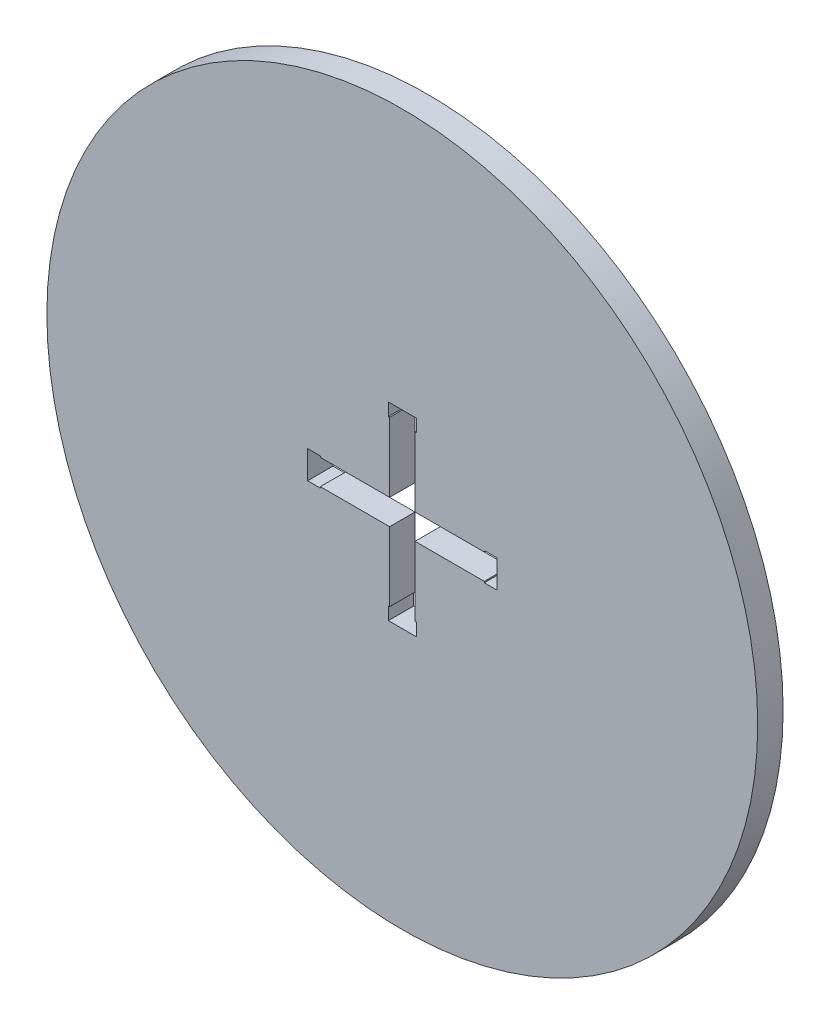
ISO-10303-21;
HEADER;
FILE_DESCRIPTION(('STEP AP214'),'2;1');
FILE_NAME('part.step','',(''),(''),'','','');
FILE_SCHEMA(('AUTOMOTIVE_DESIGN { 1 0 10303 214 1 1 1 1 }'));
ENDSEC;
DATA;
#1=APPLICATION_CONTEXT('core data for automotive mechanical design processes');
#2=APPLICATION_PROTOCOL_DEFINITION('international standard','automotive_design',2000,#1);
#3=PRODUCT_CONTEXT('',#1,'mechanical');
#4=PRODUCT('Part','Part','',(#3));
#5=PRODUCT_RELATED_PRODUCT_CATEGORY('part','',(#4));
#6=PRODUCT_DEFINITION_FORMATION('','',#4);
#7=PRODUCT_DEFINITION_CONTEXT('part definition',#1,'design');
#8=PRODUCT_DEFINITION('design','',#6,#7);
#9=PRODUCT_DEFINITION_SHAPE('','',#8);
#10=(LENGTH_UNIT() NAMED_UNIT(*) SI_UNIT(.MILLI.,.METRE.));
#11=(NAMED_UNIT(*) PLANE_ANGLE_UNIT() SI_UNIT($,.RADIAN.));
#12=(NAMED_UNIT(*) SI_UNIT($,.STERADIAN.) SOLID_ANGLE_UNIT());
#13=UNCERTAINTY_MEASURE_WITH_UNIT(LENGTH_MEASURE(1.E-05),#10,'distance_accuracy_value','');
#14=(GEOMETRIC_REPRESENTATION_CONTEXT(3) GLOBAL_UNCERTAINTY_ASSIGNED_CONTEXT((#13)) GLOBAL_UNIT_ASSIGNED_CONTEXT((#10,
#11,#12)) REPRESENTATION_CONTEXT('',''));
#15=CARTESIAN_POINT('',(0.,0.,0.));
#16=DIRECTION('',(0.,0.,1.));
#17=DIRECTION('',(1.,0.,0.));
#18=AXIS2_PLACEMENT_3D('',#15,#16,#17);
#19=CARTESIAN_POINT('',(0.,0.,12.7));
#20=DIRECTION('',(0.,0.,1.));
#21=DIRECTION('',(1.,0.,0.));
#22=AXIS2_PLACEMENT_3D('',#19,#20,#21);
#23=PLANE('',#22);
#24=DIRECTION('',(1.,0.,0.));
#25=VECTOR('',#24,1.);
#26=CARTESIAN_POINT('',(-6.35000000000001,-41.021,12.7));
#27=LINE('',#26,#25);
#28=CARTESIAN_POINT('',(-6.98500000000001,-41.021,12.7));
#29=VERTEX_POINT('',#28);
#30=CARTESIAN_POINT('',(-6.35000000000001,-41.021,12.7));
#31=VERTEX_POINT('',#30);
#32=EDGE_CURVE('E240',#29,#31,#27,.T.);
#33=ORIENTED_EDGE('',*,*,#32,.T.);
#34=DIRECTION('',(0.,-1.,0.));
#35=VECTOR('',#34,1.);
#36=CARTESIAN_POINT('',(-6.35000000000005,-6.35,12.7));
#37=LINE('',#36,#35);
#38=CARTESIAN_POINT('',(-6.35000000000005,-6.35,12.7));
#39=VERTEX_POINT('',#38);
#40=EDGE_CURVE('E230',#39,#31,#37,.T.);
#41=ORIENTED_EDGE('',*,*,#40,.F.);
#42=DIRECTION('',(1.,0.,0.));
#43=VECTOR('',#42,1.);
#44=CARTESIAN_POINT('',(-47.371,-6.35,12.7));
#45=LINE('',#44,#43);
#46=CARTESIAN_POINT('',(-41.021,-6.35,12.7));
#47=VERTEX_POINT('',#46);
#48=EDGE_CURVE('E388',#47,#39,#45,.T.);
#49=ORIENTED_EDGE('',*,*,#48,.F.);
#50=DIRECTION('',(0.,-1.,0.));
#51=VECTOR('',#50,1.);
#52=CARTESIAN_POINT('',(-41.021,-6.35000000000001,12.7));
#53=LINE('',#52,#51);
#54=CARTESIAN_POINT('',(-41.021,-6.98500000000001,12.7));
#55=VERTEX_POINT('',#54);
#56=EDGE_CURVE('E48',#47,#55,#53,.T.);
#57=ORIENTED_EDGE('',*,*,#56,.T.);
#58=DIRECTION('',(-1.,0.,0.));
#59=VECTOR('',#58,1.);
#60=CARTESIAN_POINT('',(-47.371,-6.98500000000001,12.7));
#61=LINE('',#60,#59);
#62=CARTESIAN_POINT('',(-47.371,-6.98500000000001,12.7));
#63=VERTEX_POINT('',#62);
#64=EDGE_CURVE('E258',#55,#63,#61,.T.);
#65=ORIENTED_EDGE('',*,*,#64,.T.);
#66=DIRECTION('',(0.,-1.,0.));
#67=VECTOR('',#66,1.);
#68=CARTESIAN_POINT('',(-47.371,6.35,12.7));
#69=LINE('',#68,#67);
#70=CARTESIAN_POINT('',(-47.371,6.98500000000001,12.7));
#71=VERTEX_POINT('',#70);
#72=EDGE_CURVE('E386',#71,#63,#69,.T.);
#73=ORIENTED_EDGE('',*,*,#72,.F.);
#74=DIRECTION('',(-1.,0.,0.));
#75=VECTOR('',#74,1.);
#76=CARTESIAN_POINT('',(-47.371,6.98500000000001,12.7));
#77=LINE('',#76,#75);
#78=CARTESIAN_POINT('',(-41.021,6.98500000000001,12.7));
#79=VERTEX_POINT('',#78);
#80=EDGE_CURVE('E292',#79,#71,#77,.T.);
#81=ORIENTED_EDGE('',*,*,#80,.F.);
#82=DIRECTION('',(0.,1.,0.));
#83=VECTOR('',#82,1.);
#84=CARTESIAN_POINT('',(-41.021,6.35000000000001,12.7));
#85=LINE('',#84,#83);
#86=CARTESIAN_POINT('',(-41.021,6.35000000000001,12.7));
#87=VERTEX_POINT('',#86);
#88=EDGE_CURVE('E295',#87,#79,#85,.T.);
#89=ORIENTED_EDGE('',*,*,#88,.F.);
#90=DIRECTION('',(-1.,0.,0.));
#91=VECTOR('',#90,1.);
#92=CARTESIAN_POINT('',(-6.35000000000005,6.35,12.7));
#93=LINE('',#92,#91);
#94=CARTESIAN_POINT('',(-6.35000000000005,6.35,12.7));
#95=VERTEX_POINT('',#94);
#96=EDGE_CURVE('E382',#95,#87,#93,.T.);
#97=ORIENTED_EDGE('',*,*,#96,.F.);
#98=DIRECTION('',(0.,-1.,0.));
#99=VECTOR('',#98,1.);
#100=CARTESIAN_POINT('',(-6.34999999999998,47.371,12.7));
#101=LINE('',#100,#99);
#102=CARTESIAN_POINT('',(-6.35000000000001,41.021,12.7));
#103=VERTEX_POINT('',#102);
#104=EDGE_CURVE('E380',#103,#95,#101,.T.);
#105=ORIENTED_EDGE('',*,*,#104,.F.);
#106=DIRECTION('',(1.,0.,0.));
#107=VECTOR('',#106,1.);
#108=CARTESIAN_POINT('',(-6.35000000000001,41.021,12.7));
#109=LINE('',#108,#107);
#110=CARTESIAN_POINT('',(-6.98500000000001,41.021,12.7));
#111=VERTEX_POINT('',#110);
#112=EDGE_CURVE('E273',#111,#103,#109,.T.);
#113=ORIENTED_EDGE('',*,*,#112,.F.);
#114=DIRECTION('',(0.,-1.,0.));
#115=VECTOR('',#114,1.);
#116=CARTESIAN_POINT('',(-6.98500000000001,47.371,12.7));
#117=LINE('',#116,#115);
#118=CARTESIAN_POINT('',(-6.98500000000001,47.371,12.7));
#119=VERTEX_POINT('',#118);
#120=EDGE_CURVE('E275',#119,#111,#117,.T.);
#121=ORIENTED_EDGE('',*,*,#120,.F.);
#122=DIRECTION('',(-1.,0.,0.));
#123=VECTOR('',#122,1.);
#124=CARTESIAN_POINT('',(6.35000000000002,47.371,12.7));
#125=LINE('',#124,#123);
#126=CARTESIAN_POINT('',(6.98500000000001,47.371,12.7));
#127=VERTEX_POINT('',#126);
#128=EDGE_CURVE('E403',#127,#119,#125,.T.);
#129=ORIENTED_EDGE('',*,*,#128,.F.);
#130=DIRECTION('',(0.,-1.,0.));
#131=VECTOR('',#130,1.);
#132=CARTESIAN_POINT('',(6.98500000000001,47.371,12.7));
#133=LINE('',#132,#131);
#134=CARTESIAN_POINT('',(6.98500000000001,41.021,12.7));
#135=VERTEX_POINT('',#134);
#136=EDGE_CURVE('E342',#127,#135,#133,.T.);
#137=ORIENTED_EDGE('',*,*,#136,.T.);
#138=DIRECTION('',(-1.,0.,0.));
#139=VECTOR('',#138,1.);
#140=CARTESIAN_POINT('',(6.35000000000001,41.021,12.7));
#141=LINE('',#140,#139);
#142=CARTESIAN_POINT('',(6.35000000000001,41.021,12.7));
#143=VERTEX_POINT('',#142);
#144=EDGE_CURVE('E345',#135,#143,#141,.T.);
#145=ORIENTED_EDGE('',*,*,#144,.T.);
#146=DIRECTION('',(0.,1.,0.));
#147=VECTOR('',#146,1.);
#148=CARTESIAN_POINT('',(6.35000000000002,47.371,12.7));
#149=LINE('',#148,#147);
#150=CARTESIAN_POINT('',(6.35000000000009,6.35,12.7));
#151=VERTEX_POINT('',#150);
#152=EDGE_CURVE('E400',#151,#143,#149,.T.);
#153=ORIENTED_EDGE('',*,*,#152,.F.);
#154=DIRECTION('',(-1.,0.,0.));
#155=VECTOR('',#154,1.);
#156=CARTESIAN_POINT('',(6.35000000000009,6.35,12.7));
#157=LINE('',#156,#155);
#158=CARTESIAN_POINT('',(41.021,6.35000000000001,12.7));
#159=VERTEX_POINT('',#158);
#160=EDGE_CURVE('E398',#159,#151,#157,.T.);
#161=ORIENTED_EDGE('',*,*,#160,.F.);
#162=DIRECTION('',(0.,1.,0.));
#163=VECTOR('',#162,1.);
#164=CARTESIAN_POINT('',(41.021,6.35000000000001,12.7));
#165=LINE('',#164,#163);
#166=CARTESIAN_POINT('',(41.021,6.98500000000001,12.7));
#167=VERTEX_POINT('',#166);
#168=EDGE_CURVE('E363',#159,#167,#165,.T.);
#169=ORIENTED_EDGE('',*,*,#168,.T.);
#170=DIRECTION('',(1.,0.,0.));
#171=VECTOR('',#170,1.);
#172=CARTESIAN_POINT('',(47.371,6.98500000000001,12.7));
#173=LINE('',#172,#171);
#174=CARTESIAN_POINT('',(47.371,6.98500000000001,12.7));
#175=VERTEX_POINT('',#174);
#176=EDGE_CURVE('E366',#167,#175,#173,.T.);
#177=ORIENTED_EDGE('',*,*,#176,.T.);
#178=DIRECTION('',(0.,1.,0.));
#179=VECTOR('',#178,1.);
#180=CARTESIAN_POINT('',(47.371,6.35000000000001,12.7));
#181=LINE('',#180,#179);
#182=CARTESIAN_POINT('',(47.371,-6.98500000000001,12.7));
#183=VERTEX_POINT('',#182);
#184=EDGE_CURVE('E396',#183,#175,#181,.T.);
#185=ORIENTED_EDGE('',*,*,#184,.F.);
#186=DIRECTION('',(1.,0.,0.));
#187=VECTOR('',#186,1.);
#188=CARTESIAN_POINT('',(47.371,-6.98500000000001,12.7));
#189=LINE('',#188,#187);
#190=CARTESIAN_POINT('',(41.021,-6.98500000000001,12.7));
#191=VERTEX_POINT('',#190);
#192=EDGE_CURVE('E325',#191,#183,#189,.T.);
#193=ORIENTED_EDGE('',*,*,#192,.F.);
#194=DIRECTION('',(0.,-1.,0.));
#195=VECTOR('',#194,1.);
#196=CARTESIAN_POINT('',(41.021,-6.35000000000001,12.7));
#197=LINE('',#196,#195);
#198=CARTESIAN_POINT('',(41.021,-6.35000000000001,12.7));
#199=VERTEX_POINT('',#198);
#200=EDGE_CURVE('E328',#199,#191,#197,.T.);
#201=ORIENTED_EDGE('',*,*,#200,.F.);
#202=DIRECTION('',(1.,0.,0.));
#203=VECTOR('',#202,1.);
#204=CARTESIAN_POINT('',(47.371,-6.35000000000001,12.7));
#205=LINE('',#204,#203);
#206=CARTESIAN_POINT('',(6.35000000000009,-6.35,12.7));
#207=VERTEX_POINT('',#206);
#208=EDGE_CURVE('E393',#207,#199,#205,.T.);
#209=ORIENTED_EDGE('',*,*,#208,.F.);
#210=DIRECTION('',(0.,1.,0.));
#211=VECTOR('',#210,1.);
#212=CARTESIAN_POINT('',(6.35000000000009,-6.35,12.7));
#213=LINE('',#212,#211);
#214=CARTESIAN_POINT('',(6.35000000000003,-41.021,12.7));
#215=VERTEX_POINT('',#214);
#216=EDGE_CURVE('E229',#215,#207,#213,.T.);
#217=ORIENTED_EDGE('',*,*,#216,.F.);
#218=DIRECTION('',(-1.,0.,0.));
#219=VECTOR('',#218,1.);
#220=CARTESIAN_POINT('',(6.35000000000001,-41.021,12.7));
#221=LINE('',#220,#219);
#222=CARTESIAN_POINT('',(6.98500000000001,-41.021,12.7));
#223=VERTEX_POINT('',#222);
#224=EDGE_CURVE('E56',#223,#215,#221,.T.);
#225=ORIENTED_EDGE('',*,*,#224,.F.);
#226=DIRECTION('',(0.,1.,0.));
#227=VECTOR('',#226,1.);
#228=CARTESIAN_POINT('',(6.98500000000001,-47.371,12.7));
#229=LINE('',#228,#227);
#230=CARTESIAN_POINT('',(6.98500000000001,-47.371,12.7));
#231=VERTEX_POINT('',#230);
#232=EDGE_CURVE('E225',#231,#223,#229,.T.);
#233=ORIENTED_EDGE('',*,*,#232,.F.);
#234=DIRECTION('',(1.,0.,0.));
#235=VECTOR('',#234,1.);
#236=CARTESIAN_POINT('',(-6.34999999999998,-47.371,12.7));
#237=LINE('',#236,#235);
#238=CARTESIAN_POINT('',(-6.98500000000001,-47.371,12.7));
#239=VERTEX_POINT('',#238);
#240=EDGE_CURVE('E219',#239,#231,#237,.T.);
#241=ORIENTED_EDGE('',*,*,#240,.F.);
#242=DIRECTION('',(0.,1.,0.));
#243=VECTOR('',#242,1.);
#244=CARTESIAN_POINT('',(-6.98500000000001,-47.371,12.7));
#245=LINE('',#244,#243);
#246=EDGE_CURVE('E224',#239,#29,#245,.T.);
#247=ORIENTED_EDGE('',*,*,#246,.T.);
#248=EDGE_LOOP('',(#33,#41,#49,#57,#65,#73,#81,#89,#97,#105,#113,#121,#129,#137,#145,#153,#161,
#169,#177,#185,#193,#201,#209,#217,#225,#233,#241,#247));
#249=FACE_BOUND('',#248,.T.);
#250=CARTESIAN_POINT('',(0.,0.,12.7));
#251=DIRECTION('',(0.,0.,1.));
#252=DIRECTION('',(1.,0.,0.));
#253=AXIS2_PLACEMENT_3D('',#250,#251,#252);
#254=CIRCLE('',#253,177.8);
#255=CARTESIAN_POINT('',(177.8,0.,12.7));
#256=VERTEX_POINT('',#255);
#257=EDGE_CURVE('E11',#256,#256,#254,.T.);
#258=ORIENTED_EDGE('',*,*,#257,.T.);
#259=EDGE_LOOP('',(#258));
#260=FACE_BOUND('',#259,.T.);
#261=ADVANCED_FACE('F33',(#249,#260),#23,.T.);
#262=CARTESIAN_POINT('',(0.,0.,0.));
#263=DIRECTION('',(0.,0.,1.));
#264=DIRECTION('',(1.,0.,0.));
#265=AXIS2_PLACEMENT_3D('',#262,#263,#264);
#266=PLANE('',#265);
#267=CARTESIAN_POINT('',(0.,0.,0.));
#268=DIRECTION('',(0.,0.,1.));
#269=DIRECTION('',(1.,0.,0.));
#270=AXIS2_PLACEMENT_3D('',#267,#268,#269);
#271=CIRCLE('',#270,177.8);
#272=CARTESIAN_POINT('',(177.8,0.,0.));
#273=VERTEX_POINT('',#272);
#274=EDGE_CURVE('E37',#273,#273,#271,.T.);
#275=ORIENTED_EDGE('',*,*,#274,.F.);
#276=EDGE_LOOP('',(#275));
#277=FACE_BOUND('',#276,.T.);
#278=DIRECTION('',(0.,-1.,0.));
#279=VECTOR('',#278,1.);
#280=CARTESIAN_POINT('',(-6.35000000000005,-6.35,0.));
#281=LINE('',#280,#279);
#282=CARTESIAN_POINT('',(-6.35000000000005,-6.35,0.));
#283=VERTEX_POINT('',#282);
#284=CARTESIAN_POINT('',(-6.35000000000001,-41.021,0.));
#285=VERTEX_POINT('',#284);
#286=EDGE_CURVE('E414',#283,#285,#281,.T.);
#287=ORIENTED_EDGE('',*,*,#286,.T.);
#288=DIRECTION('',(1.,0.,0.));
#289=VECTOR('',#288,1.);
#290=CARTESIAN_POINT('',(-6.35000000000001,-41.021,0.));
#291=LINE('',#290,#289);
#292=CARTESIAN_POINT('',(-6.98500000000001,-41.021,0.));
#293=VERTEX_POINT('',#292);
#294=EDGE_CURVE('E244',#293,#285,#291,.T.);
#295=ORIENTED_EDGE('',*,*,#294,.F.);
#296=DIRECTION('',(0.,1.,0.));
#297=VECTOR('',#296,1.);
#298=CARTESIAN_POINT('',(-6.98500000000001,-47.371,0.));
#299=LINE('',#298,#297);
#300=CARTESIAN_POINT('',(-6.98500000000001,-47.371,0.));
#301=VERTEX_POINT('',#300);
#302=EDGE_CURVE('E247',#301,#293,#299,.T.);
#303=ORIENTED_EDGE('',*,*,#302,.F.);
#304=DIRECTION('',(1.,0.,0.));
#305=VECTOR('',#304,1.);
#306=CARTESIAN_POINT('',(-6.34999999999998,-47.371,0.));
#307=LINE('',#306,#305);
#308=CARTESIAN_POINT('',(6.98500000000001,-47.371,0.));
#309=VERTEX_POINT('',#308);
#310=EDGE_CURVE('E235',#301,#309,#307,.T.);
#311=ORIENTED_EDGE('',*,*,#310,.T.);
#312=DIRECTION('',(0.,1.,0.));
#313=VECTOR('',#312,1.);
#314=CARTESIAN_POINT('',(6.98500000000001,-47.371,0.));
#315=LINE('',#314,#313);
#316=CARTESIAN_POINT('',(6.98500000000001,-41.021,0.));
#317=VERTEX_POINT('',#316);
#318=EDGE_CURVE('E310',#309,#317,#315,.T.);
#319=ORIENTED_EDGE('',*,*,#318,.T.);
#320=DIRECTION('',(-1.,0.,0.));
#321=VECTOR('',#320,1.);
#322=CARTESIAN_POINT('',(6.35000000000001,-41.021,0.));
#323=LINE('',#322,#321);
#324=CARTESIAN_POINT('',(6.35000000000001,-41.021,0.));
#325=VERTEX_POINT('',#324);
#326=EDGE_CURVE('E313',#317,#325,#323,.T.);
#327=ORIENTED_EDGE('',*,*,#326,.T.);
#328=DIRECTION('',(0.,1.,0.));
#329=VECTOR('',#328,1.);
#330=CARTESIAN_POINT('',(6.35000000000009,-6.35,0.));
#331=LINE('',#330,#329);
#332=CARTESIAN_POINT('',(6.35000000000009,-6.35,0.));
#333=VERTEX_POINT('',#332);
#334=EDGE_CURVE('E418',#325,#333,#331,.T.);
#335=ORIENTED_EDGE('',*,*,#334,.T.);
#336=DIRECTION('',(1.,0.,0.));
#337=VECTOR('',#336,1.);
#338=CARTESIAN_POINT('',(47.371,-6.35000000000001,0.));
#339=LINE('',#338,#337);
#340=CARTESIAN_POINT('',(41.021,-6.35000000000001,0.));
#341=VERTEX_POINT('',#340);
#342=EDGE_CURVE('E420',#333,#341,#339,.T.);
#343=ORIENTED_EDGE('',*,*,#342,.T.);
#344=DIRECTION('',(0.,-1.,0.));
#345=VECTOR('',#344,1.);
#346=CARTESIAN_POINT('',(41.021,-6.35000000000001,0.));
#347=LINE('',#346,#345);
#348=CARTESIAN_POINT('',(41.021,-6.98500000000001,0.));
#349=VERTEX_POINT('',#348);
#350=EDGE_CURVE('E329',#341,#349,#347,.T.);
#351=ORIENTED_EDGE('',*,*,#350,.T.);
#352=DIRECTION('',(1.,0.,0.));
#353=VECTOR('',#352,1.);
#354=CARTESIAN_POINT('',(47.371,-6.98500000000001,0.));
#355=LINE('',#354,#353);
#356=CARTESIAN_POINT('',(47.371,-6.98500000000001,0.));
#357=VERTEX_POINT('',#356);
#358=EDGE_CURVE('E288',#349,#357,#355,.T.);
#359=ORIENTED_EDGE('',*,*,#358,.T.);
#360=DIRECTION('',(0.,1.,0.));
#361=VECTOR('',#360,1.);
#362=CARTESIAN_POINT('',(47.371,6.35000000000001,0.));
#363=LINE('',#362,#361);
#364=CARTESIAN_POINT('',(47.371,6.98500000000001,0.));
#365=VERTEX_POINT('',#364);
#366=EDGE_CURVE('E423',#357,#365,#363,.T.);
#367=ORIENTED_EDGE('',*,*,#366,.T.);
#368=DIRECTION('',(1.,0.,0.));
#369=VECTOR('',#368,1.);
#370=CARTESIAN_POINT('',(47.371,6.98500000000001,0.));
#371=LINE('',#370,#369);
#372=CARTESIAN_POINT('',(41.021,6.98500000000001,0.));
#373=VERTEX_POINT('',#372);
#374=EDGE_CURVE('E367',#373,#365,#371,.T.);
#375=ORIENTED_EDGE('',*,*,#374,.F.);
#376=DIRECTION('',(0.,1.,0.));
#377=VECTOR('',#376,1.);
#378=CARTESIAN_POINT('',(41.021,6.35000000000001,0.));
#379=LINE('',#378,#377);
#380=CARTESIAN_POINT('',(41.021,6.35000000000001,0.));
#381=VERTEX_POINT('',#380);
#382=EDGE_CURVE('E321',#381,#373,#379,.T.);
#383=ORIENTED_EDGE('',*,*,#382,.F.);
#384=DIRECTION('',(-1.,0.,0.));
#385=VECTOR('',#384,1.);
#386=CARTESIAN_POINT('',(6.35000000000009,6.35,0.));
#387=LINE('',#386,#385);
#388=CARTESIAN_POINT('',(6.35000000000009,6.35,0.));
#389=VERTEX_POINT('',#388);
#390=EDGE_CURVE('E425',#381,#389,#387,.T.);
#391=ORIENTED_EDGE('',*,*,#390,.T.);
#392=DIRECTION('',(0.,1.,0.));
#393=VECTOR('',#392,1.);
#394=CARTESIAN_POINT('',(6.35000000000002,47.371,0.));
#395=LINE('',#394,#393);
#396=CARTESIAN_POINT('',(6.35000000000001,41.021,0.));
#397=VERTEX_POINT('',#396);
#398=EDGE_CURVE('E427',#389,#397,#395,.T.);
#399=ORIENTED_EDGE('',*,*,#398,.T.);
#400=DIRECTION('',(-1.,0.,0.));
#401=VECTOR('',#400,1.);
#402=CARTESIAN_POINT('',(6.35000000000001,41.021,0.));
#403=LINE('',#402,#401);
#404=CARTESIAN_POINT('',(6.98500000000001,41.021,0.));
#405=VERTEX_POINT('',#404);
#406=EDGE_CURVE('E346',#405,#397,#403,.T.);
#407=ORIENTED_EDGE('',*,*,#406,.F.);
#408=DIRECTION('',(0.,-1.,0.));
#409=VECTOR('',#408,1.);
#410=CARTESIAN_POINT('',(6.98500000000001,47.371,0.));
#411=LINE('',#410,#409);
#412=CARTESIAN_POINT('',(6.98500000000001,47.371,0.));
#413=VERTEX_POINT('',#412);
#414=EDGE_CURVE('E350',#413,#405,#411,.T.);
#415=ORIENTED_EDGE('',*,*,#414,.F.);
#416=DIRECTION('',(-1.,0.,0.));
#417=VECTOR('',#416,1.);
#418=CARTESIAN_POINT('',(6.35000000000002,47.371,0.));
#419=LINE('',#418,#417);
#420=CARTESIAN_POINT('',(-6.98500000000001,47.371,0.));
#421=VERTEX_POINT('',#420);
#422=EDGE_CURVE('E383',#413,#421,#419,.T.);
#423=ORIENTED_EDGE('',*,*,#422,.T.);
#424=DIRECTION('',(0.,-1.,0.));
#425=VECTOR('',#424,1.);
#426=CARTESIAN_POINT('',(-6.98500000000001,47.371,0.));
#427=LINE('',#426,#425);
#428=CARTESIAN_POINT('',(-6.98500000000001,41.021,0.));
#429=VERTEX_POINT('',#428);
#430=EDGE_CURVE('E276',#421,#429,#427,.T.);
#431=ORIENTED_EDGE('',*,*,#430,.T.);
#432=DIRECTION('',(1.,0.,0.));
#433=VECTOR('',#432,1.);
#434=CARTESIAN_POINT('',(-6.35000000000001,41.021,0.));
#435=LINE('',#434,#433);
#436=CARTESIAN_POINT('',(-6.35000000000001,41.021,0.));
#437=VERTEX_POINT('',#436);
#438=EDGE_CURVE('E279',#429,#437,#435,.T.);
#439=ORIENTED_EDGE('',*,*,#438,.T.);
#440=DIRECTION('',(0.,-1.,0.));
#441=VECTOR('',#440,1.);
#442=CARTESIAN_POINT('',(-6.34999999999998,47.371,0.));
#443=LINE('',#442,#441);
#444=CARTESIAN_POINT('',(-6.35000000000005,6.35,0.));
#445=VERTEX_POINT('',#444);
#446=EDGE_CURVE('E358',#437,#445,#443,.T.);
#447=ORIENTED_EDGE('',*,*,#446,.T.);
#448=DIRECTION('',(-1.,0.,0.));
#449=VECTOR('',#448,1.);
#450=CARTESIAN_POINT('',(-6.35000000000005,6.35,0.));
#451=LINE('',#450,#449);
#452=CARTESIAN_POINT('',(-41.021,6.35000000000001,0.));
#453=VERTEX_POINT('',#452);
#454=EDGE_CURVE('E407',#445,#453,#451,.T.);
#455=ORIENTED_EDGE('',*,*,#454,.T.);
#456=DIRECTION('',(0.,1.,0.));
#457=VECTOR('',#456,1.);
#458=CARTESIAN_POINT('',(-41.021,6.35000000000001,0.));
#459=LINE('',#458,#457);
#460=CARTESIAN_POINT('',(-41.021,6.98500000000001,0.));
#461=VERTEX_POINT('',#460);
#462=EDGE_CURVE('E296',#453,#461,#459,.T.);
#463=ORIENTED_EDGE('',*,*,#462,.T.);
#464=DIRECTION('',(-1.,0.,0.));
#465=VECTOR('',#464,1.);
#466=CARTESIAN_POINT('',(-47.371,6.98500000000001,0.));
#467=LINE('',#466,#465);
#468=CARTESIAN_POINT('',(-47.371,6.98500000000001,0.));
#469=VERTEX_POINT('',#468);
#470=EDGE_CURVE('E255',#461,#469,#467,.T.);
#471=ORIENTED_EDGE('',*,*,#470,.T.);
#472=DIRECTION('',(0.,-1.,0.));
#473=VECTOR('',#472,1.);
#474=CARTESIAN_POINT('',(-47.371,6.35,0.));
#475=LINE('',#474,#473);
#476=CARTESIAN_POINT('',(-47.371,-6.98500000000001,0.));
#477=VERTEX_POINT('',#476);
#478=EDGE_CURVE('E410',#469,#477,#475,.T.);
#479=ORIENTED_EDGE('',*,*,#478,.T.);
#480=DIRECTION('',(-1.,0.,0.));
#481=VECTOR('',#480,1.);
#482=CARTESIAN_POINT('',(-47.371,-6.98500000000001,0.));
#483=LINE('',#482,#481);
#484=CARTESIAN_POINT('',(-41.021,-6.98500000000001,0.));
#485=VERTEX_POINT('',#484);
#486=EDGE_CURVE('E259',#485,#477,#483,.T.);
#487=ORIENTED_EDGE('',*,*,#486,.F.);
#488=DIRECTION('',(0.,-1.,0.));
#489=VECTOR('',#488,1.);
#490=CARTESIAN_POINT('',(-41.021,-6.35000000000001,0.));
#491=LINE('',#490,#489);
#492=CARTESIAN_POINT('',(-41.021,-6.35000000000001,0.));
#493=VERTEX_POINT('',#492);
#494=EDGE_CURVE('E263',#493,#485,#491,.T.);
#495=ORIENTED_EDGE('',*,*,#494,.F.);
#496=DIRECTION('',(1.,0.,0.));
#497=VECTOR('',#496,1.);
#498=CARTESIAN_POINT('',(-47.371,-6.35,0.));
#499=LINE('',#498,#497);
#500=EDGE_CURVE('E412',#493,#283,#499,.T.);
#501=ORIENTED_EDGE('',*,*,#500,.T.);
#502=EDGE_LOOP('',(#287,#295,#303,#311,#319,#327,#335,#343,#351,#359,#367,#375,#383,#391,#399,
#407,#415,#423,#431,#439,#447,#455,#463,#471,#479,#487,#495,#501));
#503=FACE_BOUND('',#502,.T.);
#504=ADVANCED_FACE('F448',(#277,#503),#266,.F.);
#505=CARTESIAN_POINT('',(-6.34999999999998,47.371,12.7));
#506=DIRECTION('',(1.,0.,0.));
#507=DIRECTION('',(0.,1.,0.));
#508=AXIS2_PLACEMENT_3D('',#505,#506,#507);
#509=PLANE('',#508);
#510=ORIENTED_EDGE('',*,*,#446,.F.);
#511=DIRECTION('',(0.,0.,-1.));
#512=VECTOR('',#511,1.);
#513=CARTESIAN_POINT('',(-6.35000000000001,41.021,12.7));
#514=LINE('',#513,#512);
#515=EDGE_CURVE('E278',#103,#437,#514,.T.);
#516=ORIENTED_EDGE('',*,*,#515,.F.);
#517=ORIENTED_EDGE('',*,*,#104,.T.);
#518=DIRECTION('',(0.,0.,-1.));
#519=VECTOR('',#518,1.);
#520=CARTESIAN_POINT('',(-6.35000000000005,6.35,12.7));
#521=LINE('',#520,#519);
#522=EDGE_CURVE('E439',#95,#445,#521,.T.);
#523=ORIENTED_EDGE('',*,*,#522,.T.);
#524=EDGE_LOOP('',(#510,#516,#517,#523));
#525=FACE_BOUND('',#524,.T.);
#526=ADVANCED_FACE('F451',(#525),#509,.T.);
#527=CARTESIAN_POINT('',(-6.35000000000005,6.35,12.7));
#528=DIRECTION('',(0.,-1.,0.));
#529=DIRECTION('',(1.,0.,0.));
#530=AXIS2_PLACEMENT_3D('',#527,#528,#529);
#531=PLANE('',#530);
#532=ORIENTED_EDGE('',*,*,#96,.T.);
#533=DIRECTION('',(0.,0.,-1.));
#534=VECTOR('',#533,1.);
#535=CARTESIAN_POINT('',(-41.021,6.35000000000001,12.7));
#536=LINE('',#535,#534);
#537=EDGE_CURVE('E282',#87,#453,#536,.T.);
#538=ORIENTED_EDGE('',*,*,#537,.T.);
#539=ORIENTED_EDGE('',*,*,#454,.F.);
#540=ORIENTED_EDGE('',*,*,#522,.F.);
#541=EDGE_LOOP('',(#532,#538,#539,#540));
#542=FACE_BOUND('',#541,.T.);
#543=ADVANCED_FACE('F496',(#542),#531,.T.);
#544=CARTESIAN_POINT('',(6.35000000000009,-6.35,12.7));
#545=DIRECTION('',(-1.,0.,0.));
#546=DIRECTION('',(0.,-1.,0.));
#547=AXIS2_PLACEMENT_3D('',#544,#545,#546);
#548=PLANE('',#547);
#549=ORIENTED_EDGE('',*,*,#334,.F.);
#550=DIRECTION('',(0.,0.,-1.));
#551=VECTOR('',#550,1.);
#552=CARTESIAN_POINT('',(6.35000000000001,-41.021,12.7));
#553=LINE('',#552,#551);
#554=EDGE_CURVE('E312',#215,#325,#553,.T.);
#555=ORIENTED_EDGE('',*,*,#554,.F.);
#556=ORIENTED_EDGE('',*,*,#216,.T.);
#557=DIRECTION('',(0.,0.,-1.));
#558=VECTOR('',#557,1.);
#559=CARTESIAN_POINT('',(6.35000000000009,-6.35,12.7));
#560=LINE('',#559,#558);
#561=EDGE_CURVE('E433',#207,#333,#560,.T.);
#562=ORIENTED_EDGE('',*,*,#561,.T.);
#563=EDGE_LOOP('',(#549,#555,#556,#562));
#564=FACE_BOUND('',#563,.T.);
#565=ADVANCED_FACE('F498',(#564),#548,.T.);
#566=CARTESIAN_POINT('',(47.371,-6.35000000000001,12.7));
#567=DIRECTION('',(0.,1.,0.));
#568=DIRECTION('',(-1.,0.,0.));
#569=AXIS2_PLACEMENT_3D('',#566,#567,#568);
#570=PLANE('',#569);
#571=ORIENTED_EDGE('',*,*,#208,.T.);
#572=DIRECTION('',(0.,0.,-1.));
#573=VECTOR('',#572,1.);
#574=CARTESIAN_POINT('',(41.021,-6.35000000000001,12.7));
#575=LINE('',#574,#573);
#576=EDGE_CURVE('E316',#199,#341,#575,.T.);
#577=ORIENTED_EDGE('',*,*,#576,.T.);
#578=ORIENTED_EDGE('',*,*,#342,.F.);
#579=ORIENTED_EDGE('',*,*,#561,.F.);
#580=EDGE_LOOP('',(#571,#577,#578,#579));
#581=FACE_BOUND('',#580,.T.);
#582=ADVANCED_FACE('F487',(#581),#570,.T.);
#583=CARTESIAN_POINT('',(0.,0.,12.7));
#584=DIRECTION('',(0.,0.,-1.));
#585=DIRECTION('',(-1.,0.,0.));
#586=AXIS2_PLACEMENT_3D('',#583,#584,#585);
#587=CYLINDRICAL_SURFACE('',#586,177.8);
#588=ORIENTED_EDGE('',*,*,#257,.F.);
#589=EDGE_LOOP('',(#588));
#590=FACE_BOUND('',#589,.T.);
#591=ORIENTED_EDGE('',*,*,#274,.T.);
#592=EDGE_LOOP('',(#591));
#593=FACE_BOUND('',#592,.T.);
#594=ADVANCED_FACE('F35',(#590,#593),#587,.T.);
#595=CARTESIAN_POINT('',(-47.371,6.35,12.7));
#596=DIRECTION('',(1.,0.,0.));
#597=DIRECTION('',(0.,0.,-1.));
#598=AXIS2_PLACEMENT_3D('',#595,#596,#597);
#599=PLANE('',#598);
#600=ORIENTED_EDGE('',*,*,#478,.F.);
#601=DIRECTION('',(0.,0.,-1.));
#602=VECTOR('',#601,1.);
#603=CARTESIAN_POINT('',(-47.371,6.98500000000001,12.7));
#604=LINE('',#603,#602);
#605=EDGE_CURVE('E298',#71,#469,#604,.T.);
#606=ORIENTED_EDGE('',*,*,#605,.F.);
#607=ORIENTED_EDGE('',*,*,#72,.T.);
#608=DIRECTION('',(0.,0.,-1.));
#609=VECTOR('',#608,1.);
#610=CARTESIAN_POINT('',(-47.371,-6.98500000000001,12.7));
#611=LINE('',#610,#609);
#612=EDGE_CURVE('E250',#63,#477,#611,.T.);
#613=ORIENTED_EDGE('',*,*,#612,.T.);
#614=EDGE_LOOP('',(#600,#606,#607,#613));
#615=FACE_BOUND('',#614,.T.);
#616=ADVANCED_FACE('F479',(#615),#599,.T.);
#617=CARTESIAN_POINT('',(-47.371,-6.35,12.7));
#618=DIRECTION('',(0.,1.,0.));
#619=DIRECTION('',(-1.,0.,0.));
#620=AXIS2_PLACEMENT_3D('',#617,#618,#619);
#621=PLANE('',#620);
#622=DIRECTION('',(0.,0.,-1.));
#623=VECTOR('',#622,1.);
#624=CARTESIAN_POINT('',(-41.021,-6.35000000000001,12.7));
#625=LINE('',#624,#623);
#626=EDGE_CURVE('E262',#47,#493,#625,.T.);
#627=ORIENTED_EDGE('',*,*,#626,.F.);
#628=ORIENTED_EDGE('',*,*,#48,.T.);
#629=DIRECTION('',(0.,0.,-1.));
#630=VECTOR('',#629,1.);
#631=CARTESIAN_POINT('',(-6.35000000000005,-6.35,12.7));
#632=LINE('',#631,#630);
#633=EDGE_CURVE('E436',#39,#283,#632,.T.);
#634=ORIENTED_EDGE('',*,*,#633,.T.);
#635=ORIENTED_EDGE('',*,*,#500,.F.);
#636=EDGE_LOOP('',(#627,#628,#634,#635));
#637=FACE_BOUND('',#636,.T.);
#638=ADVANCED_FACE('F464',(#637),#621,.T.);
#639=CARTESIAN_POINT('',(-6.35000000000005,-6.35,12.7));
#640=DIRECTION('',(1.,0.,0.));
#641=DIRECTION('',(0.,1.,0.));
#642=AXIS2_PLACEMENT_3D('',#639,#640,#641);
#643=PLANE('',#642);
#644=DIRECTION('',(0.,0.,-1.));
#645=VECTOR('',#644,1.);
#646=CARTESIAN_POINT('',(-6.35000000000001,-41.021,12.7));
#647=LINE('',#646,#645);
#648=EDGE_CURVE('E252',#31,#285,#647,.T.);
#649=ORIENTED_EDGE('',*,*,#648,.T.);
#650=ORIENTED_EDGE('',*,*,#286,.F.);
#651=ORIENTED_EDGE('',*,*,#633,.F.);
#652=ORIENTED_EDGE('',*,*,#40,.T.);
#653=EDGE_LOOP('',(#649,#650,#651,#652));
#654=FACE_BOUND('',#653,.T.);
#655=ADVANCED_FACE('F458',(#654),#643,.T.);
#656=CARTESIAN_POINT('',(-6.34999999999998,-47.371,12.7));
#657=DIRECTION('',(0.,1.,0.));
#658=DIRECTION('',(0.,0.,1.));
#659=AXIS2_PLACEMENT_3D('',#656,#657,#658);
#660=PLANE('',#659);
#661=ORIENTED_EDGE('',*,*,#310,.F.);
#662=DIRECTION('',(0.,0.,-1.));
#663=VECTOR('',#662,1.);
#664=CARTESIAN_POINT('',(-6.98500000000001,-47.371,12.7));
#665=LINE('',#664,#663);
#666=EDGE_CURVE('E233',#239,#301,#665,.T.);
#667=ORIENTED_EDGE('',*,*,#666,.F.);
#668=ORIENTED_EDGE('',*,*,#240,.T.);
#669=DIRECTION('',(0.,0.,-1.));
#670=VECTOR('',#669,1.);
#671=CARTESIAN_POINT('',(6.98500000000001,-47.371,12.7));
#672=LINE('',#671,#670);
#673=EDGE_CURVE('E319',#231,#309,#672,.T.);
#674=ORIENTED_EDGE('',*,*,#673,.T.);
#675=EDGE_LOOP('',(#661,#667,#668,#674));
#676=FACE_BOUND('',#675,.T.);
#677=ADVANCED_FACE('F234',(#676),#660,.T.);
#678=CARTESIAN_POINT('',(47.371,6.35000000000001,12.7));
#679=DIRECTION('',(-1.,0.,0.));
#680=DIRECTION('',(0.,0.,1.));
#681=AXIS2_PLACEMENT_3D('',#678,#679,#680);
#682=PLANE('',#681);
#683=ORIENTED_EDGE('',*,*,#366,.F.);
#684=DIRECTION('',(0.,0.,-1.));
#685=VECTOR('',#684,1.);
#686=CARTESIAN_POINT('',(47.371,-6.98500000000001,12.7));
#687=LINE('',#686,#685);
#688=EDGE_CURVE('E331',#183,#357,#687,.T.);
#689=ORIENTED_EDGE('',*,*,#688,.F.);
#690=ORIENTED_EDGE('',*,*,#184,.T.);
#691=DIRECTION('',(0.,0.,-1.));
#692=VECTOR('',#691,1.);
#693=CARTESIAN_POINT('',(47.371,6.98500000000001,12.7));
#694=LINE('',#693,#692);
#695=EDGE_CURVE('E353',#175,#365,#694,.T.);
#696=ORIENTED_EDGE('',*,*,#695,.T.);
#697=EDGE_LOOP('',(#683,#689,#690,#696));
#698=FACE_BOUND('',#697,.T.);
#699=ADVANCED_FACE('F549',(#698),#682,.T.);
#700=CARTESIAN_POINT('',(6.35000000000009,6.35,12.7));
#701=DIRECTION('',(0.,-1.,0.));
#702=DIRECTION('',(1.,0.,0.));
#703=AXIS2_PLACEMENT_3D('',#700,#701,#702);
#704=PLANE('',#703);
#705=DIRECTION('',(0.,0.,-1.));
#706=VECTOR('',#705,1.);
#707=CARTESIAN_POINT('',(41.021,6.35000000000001,12.7));
#708=LINE('',#707,#706);
#709=EDGE_CURVE('E370',#159,#381,#708,.T.);
#710=ORIENTED_EDGE('',*,*,#709,.F.);
#711=ORIENTED_EDGE('',*,*,#160,.T.);
#712=DIRECTION('',(0.,0.,-1.));
#713=VECTOR('',#712,1.);
#714=CARTESIAN_POINT('',(6.35000000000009,6.35,12.7));
#715=LINE('',#714,#713);
#716=EDGE_CURVE('E405',#151,#389,#715,.T.);
#717=ORIENTED_EDGE('',*,*,#716,.T.);
#718=ORIENTED_EDGE('',*,*,#390,.F.);
#719=EDGE_LOOP('',(#710,#711,#717,#718));
#720=FACE_BOUND('',#719,.T.);
#721=ADVANCED_FACE('F539',(#720),#704,.T.);
#722=CARTESIAN_POINT('',(6.35000000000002,47.371,12.7));
#723=DIRECTION('',(-1.,0.,0.));
#724=DIRECTION('',(0.,-1.,0.));
#725=AXIS2_PLACEMENT_3D('',#722,#723,#724);
#726=PLANE('',#725);
#727=DIRECTION('',(0.,0.,-1.));
#728=VECTOR('',#727,1.);
#729=CARTESIAN_POINT('',(6.35000000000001,41.021,12.7));
#730=LINE('',#729,#728);
#731=EDGE_CURVE('E355',#143,#397,#730,.T.);
#732=ORIENTED_EDGE('',*,*,#731,.T.);
#733=ORIENTED_EDGE('',*,*,#398,.F.);
#734=ORIENTED_EDGE('',*,*,#716,.F.);
#735=ORIENTED_EDGE('',*,*,#152,.T.);
#736=EDGE_LOOP('',(#732,#733,#734,#735));
#737=FACE_BOUND('',#736,.T.);
#738=ADVANCED_FACE('F534',(#737),#726,.T.);
#739=CARTESIAN_POINT('',(6.35000000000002,47.371,12.7));
#740=DIRECTION('',(0.,-1.,0.));
#741=DIRECTION('',(0.,0.,-1.));
#742=AXIS2_PLACEMENT_3D('',#739,#740,#741);
#743=PLANE('',#742);
#744=ORIENTED_EDGE('',*,*,#422,.F.);
#745=DIRECTION('',(0.,0.,-1.));
#746=VECTOR('',#745,1.);
#747=CARTESIAN_POINT('',(6.98500000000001,47.371,12.7));
#748=LINE('',#747,#746);
#749=EDGE_CURVE('E349',#127,#413,#748,.T.);
#750=ORIENTED_EDGE('',*,*,#749,.F.);
#751=ORIENTED_EDGE('',*,*,#128,.T.);
#752=DIRECTION('',(0.,0.,-1.));
#753=VECTOR('',#752,1.);
#754=CARTESIAN_POINT('',(-6.98500000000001,47.371,12.7));
#755=LINE('',#754,#753);
#756=EDGE_CURVE('E285',#119,#421,#755,.T.);
#757=ORIENTED_EDGE('',*,*,#756,.T.);
#758=EDGE_LOOP('',(#744,#750,#751,#757));
#759=FACE_BOUND('',#758,.T.);
#760=ADVANCED_FACE('F523',(#759),#743,.T.);
#761=CARTESIAN_POINT('',(6.35000000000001,41.021,12.7));
#762=DIRECTION('',(0.,-1.,0.));
#763=DIRECTION('',(0.,0.,-1.));
#764=AXIS2_PLACEMENT_3D('',#761,#762,#763);
#765=PLANE('',#764);
#766=ORIENTED_EDGE('',*,*,#406,.T.);
#767=ORIENTED_EDGE('',*,*,#731,.F.);
#768=ORIENTED_EDGE('',*,*,#144,.F.);
#769=DIRECTION('',(0.,0.,-1.));
#770=VECTOR('',#769,1.);
#771=CARTESIAN_POINT('',(6.98500000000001,41.021,12.7));
#772=LINE('',#771,#770);
#773=EDGE_CURVE('E359',#135,#405,#772,.T.);
#774=ORIENTED_EDGE('',*,*,#773,.T.);
#775=EDGE_LOOP('',(#766,#767,#768,#774));
#776=FACE_BOUND('',#775,.T.);
#777=ADVANCED_FACE('F583',(#776),#765,.F.);
#778=CARTESIAN_POINT('',(6.98500000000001,47.371,12.7));
#779=DIRECTION('',(1.,0.,0.));
#780=DIRECTION('',(0.,0.,-1.));
#781=AXIS2_PLACEMENT_3D('',#778,#779,#780);
#782=PLANE('',#781);
#783=ORIENTED_EDGE('',*,*,#414,.T.);
#784=ORIENTED_EDGE('',*,*,#773,.F.);
#785=ORIENTED_EDGE('',*,*,#136,.F.);
#786=ORIENTED_EDGE('',*,*,#749,.T.);
#787=EDGE_LOOP('',(#783,#784,#785,#786));
#788=FACE_BOUND('',#787,.T.);
#789=ADVANCED_FACE('F527',(#788),#782,.F.);
#790=CARTESIAN_POINT('',(47.371,6.98500000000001,12.7));
#791=DIRECTION('',(0.,1.,0.));
#792=DIRECTION('',(0.,0.,1.));
#793=AXIS2_PLACEMENT_3D('',#790,#791,#792);
#794=PLANE('',#793);
#795=ORIENTED_EDGE('',*,*,#374,.T.);
#796=ORIENTED_EDGE('',*,*,#695,.F.);
#797=ORIENTED_EDGE('',*,*,#176,.F.);
#798=DIRECTION('',(0.,0.,-1.));
#799=VECTOR('',#798,1.);
#800=CARTESIAN_POINT('',(41.021,6.98500000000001,12.7));
#801=LINE('',#800,#799);
#802=EDGE_CURVE('E377',#167,#373,#801,.T.);
#803=ORIENTED_EDGE('',*,*,#802,.T.);
#804=EDGE_LOOP('',(#795,#796,#797,#803));
#805=FACE_BOUND('',#804,.T.);
#806=ADVANCED_FACE('F547',(#805),#794,.F.);
#807=CARTESIAN_POINT('',(41.021,6.35000000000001,12.7));
#808=DIRECTION('',(-1.,0.,0.));
#809=DIRECTION('',(0.,0.,1.));
#810=AXIS2_PLACEMENT_3D('',#807,#808,#809);
#811=PLANE('',#810);
#812=ORIENTED_EDGE('',*,*,#382,.T.);
#813=ORIENTED_EDGE('',*,*,#802,.F.);
#814=ORIENTED_EDGE('',*,*,#168,.F.);
#815=ORIENTED_EDGE('',*,*,#709,.T.);
#816=EDGE_LOOP('',(#812,#813,#814,#815));
#817=FACE_BOUND('',#816,.T.);
#818=ADVANCED_FACE('F542',(#817),#811,.F.);
#819=CARTESIAN_POINT('',(41.021,-6.35000000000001,12.7));
#820=DIRECTION('',(1.,0.,0.));
#821=DIRECTION('',(0.,0.,-1.));
#822=AXIS2_PLACEMENT_3D('',#819,#820,#821);
#823=PLANE('',#822);
#824=ORIENTED_EDGE('',*,*,#350,.F.);
#825=ORIENTED_EDGE('',*,*,#576,.F.);
#826=ORIENTED_EDGE('',*,*,#200,.T.);
#827=DIRECTION('',(0.,0.,-1.));
#828=VECTOR('',#827,1.);
#829=CARTESIAN_POINT('',(41.021,-6.98500000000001,12.7));
#830=LINE('',#829,#828);
#831=EDGE_CURVE('E338',#191,#349,#830,.T.);
#832=ORIENTED_EDGE('',*,*,#831,.T.);
#833=EDGE_LOOP('',(#824,#825,#826,#832));
#834=FACE_BOUND('',#833,.T.);
#835=ADVANCED_FACE('F558',(#834),#823,.T.);
#836=CARTESIAN_POINT('',(47.371,-6.98500000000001,12.7));
#837=DIRECTION('',(0.,1.,0.));
#838=DIRECTION('',(0.,0.,1.));
#839=AXIS2_PLACEMENT_3D('',#836,#837,#838);
#840=PLANE('',#839);
#841=ORIENTED_EDGE('',*,*,#358,.F.);
#842=ORIENTED_EDGE('',*,*,#831,.F.);
#843=ORIENTED_EDGE('',*,*,#192,.T.);
#844=ORIENTED_EDGE('',*,*,#688,.T.);
#845=EDGE_LOOP('',(#841,#842,#843,#844));
#846=FACE_BOUND('',#845,.T.);
#847=ADVANCED_FACE('F556',(#846),#840,.T.);
#848=CARTESIAN_POINT('',(6.98500000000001,-47.371,12.7));
#849=DIRECTION('',(-1.,0.,0.));
#850=DIRECTION('',(0.,0.,1.));
#851=AXIS2_PLACEMENT_3D('',#848,#849,#850);
#852=PLANE('',#851);
#853=ORIENTED_EDGE('',*,*,#318,.F.);
#854=ORIENTED_EDGE('',*,*,#673,.F.);
#855=ORIENTED_EDGE('',*,*,#232,.T.);
#856=DIRECTION('',(0.,0.,-1.));
#857=VECTOR('',#856,1.);
#858=CARTESIAN_POINT('',(6.98500000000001,-41.021,12.7));
#859=LINE('',#858,#857);
#860=EDGE_CURVE('E322',#223,#317,#859,.T.);
#861=ORIENTED_EDGE('',*,*,#860,.T.);
#862=EDGE_LOOP('',(#853,#854,#855,#861));
#863=FACE_BOUND('',#862,.T.);
#864=ADVANCED_FACE('F569',(#863),#852,.T.);
#865=CARTESIAN_POINT('',(6.35000000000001,-41.021,12.7));
#866=DIRECTION('',(0.,-1.,0.));
#867=DIRECTION('',(0.,0.,-1.));
#868=AXIS2_PLACEMENT_3D('',#865,#866,#867);
#869=PLANE('',#868);
#870=ORIENTED_EDGE('',*,*,#326,.F.);
#871=ORIENTED_EDGE('',*,*,#860,.F.);
#872=ORIENTED_EDGE('',*,*,#224,.T.);
#873=ORIENTED_EDGE('',*,*,#554,.T.);
#874=EDGE_LOOP('',(#870,#871,#872,#873));
#875=FACE_BOUND('',#874,.T.);
#876=ADVANCED_FACE('F566',(#875),#869,.T.);
#877=CARTESIAN_POINT('',(-6.98500000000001,47.371,12.7));
#878=DIRECTION('',(1.,0.,0.));
#879=DIRECTION('',(0.,0.,-1.));
#880=AXIS2_PLACEMENT_3D('',#877,#878,#879);
#881=PLANE('',#880);
#882=ORIENTED_EDGE('',*,*,#430,.F.);
#883=ORIENTED_EDGE('',*,*,#756,.F.);
#884=ORIENTED_EDGE('',*,*,#120,.T.);
#885=DIRECTION('',(0.,0.,-1.));
#886=VECTOR('',#885,1.);
#887=CARTESIAN_POINT('',(-6.98500000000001,41.021,12.7));
#888=LINE('',#887,#886);
#889=EDGE_CURVE('E289',#111,#429,#888,.T.);
#890=ORIENTED_EDGE('',*,*,#889,.T.);
#891=EDGE_LOOP('',(#882,#883,#884,#890));
#892=FACE_BOUND('',#891,.T.);
#893=ADVANCED_FACE('F521',(#892),#881,.T.);
#894=CARTESIAN_POINT('',(-6.35000000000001,41.021,12.7));
#895=DIRECTION('',(0.,1.,0.));
#896=DIRECTION('',(0.,0.,1.));
#897=AXIS2_PLACEMENT_3D('',#894,#895,#896);
#898=PLANE('',#897);
#899=ORIENTED_EDGE('',*,*,#438,.F.);
#900=ORIENTED_EDGE('',*,*,#889,.F.);
#901=ORIENTED_EDGE('',*,*,#112,.T.);
#902=ORIENTED_EDGE('',*,*,#515,.T.);
#903=EDGE_LOOP('',(#899,#900,#901,#902));
#904=FACE_BOUND('',#903,.T.);
#905=ADVANCED_FACE('F514',(#904),#898,.T.);
#906=CARTESIAN_POINT('',(-41.021,6.35000000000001,12.7));
#907=DIRECTION('',(-1.,0.,0.));
#908=DIRECTION('',(0.,0.,1.));
#909=AXIS2_PLACEMENT_3D('',#906,#907,#908);
#910=PLANE('',#909);
#911=ORIENTED_EDGE('',*,*,#462,.F.);
#912=ORIENTED_EDGE('',*,*,#537,.F.);
#913=ORIENTED_EDGE('',*,*,#88,.T.);
#914=DIRECTION('',(0.,0.,-1.));
#915=VECTOR('',#914,1.);
#916=CARTESIAN_POINT('',(-41.021,6.98500000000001,12.7));
#917=LINE('',#916,#915);
#918=EDGE_CURVE('E305',#79,#461,#917,.T.);
#919=ORIENTED_EDGE('',*,*,#918,.T.);
#920=EDGE_LOOP('',(#911,#912,#913,#919));
#921=FACE_BOUND('',#920,.T.);
#922=ADVANCED_FACE('F510',(#921),#910,.T.);
#923=CARTESIAN_POINT('',(-47.371,6.98500000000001,12.7));
#924=DIRECTION('',(0.,-1.,0.));
#925=DIRECTION('',(0.,0.,-1.));
#926=AXIS2_PLACEMENT_3D('',#923,#924,#925);
#927=PLANE('',#926);
#928=ORIENTED_EDGE('',*,*,#470,.F.);
#929=ORIENTED_EDGE('',*,*,#918,.F.);
#930=ORIENTED_EDGE('',*,*,#80,.T.);
#931=ORIENTED_EDGE('',*,*,#605,.T.);
#932=EDGE_LOOP('',(#928,#929,#930,#931));
#933=FACE_BOUND('',#932,.T.);
#934=ADVANCED_FACE('F478',(#933),#927,.T.);
#935=CARTESIAN_POINT('',(-6.35000000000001,-41.021,12.7));
#936=DIRECTION('',(0.,1.,0.));
#937=DIRECTION('',(0.,0.,1.));
#938=AXIS2_PLACEMENT_3D('',#935,#936,#937);
#939=PLANE('',#938);
#940=ORIENTED_EDGE('',*,*,#294,.T.);
#941=ORIENTED_EDGE('',*,*,#648,.F.);
#942=ORIENTED_EDGE('',*,*,#32,.F.);
#943=DIRECTION('',(0.,0.,-1.));
#944=VECTOR('',#943,1.);
#945=CARTESIAN_POINT('',(-6.98500000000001,-41.021,12.7));
#946=LINE('',#945,#944);
#947=EDGE_CURVE('E239',#29,#293,#946,.T.);
#948=ORIENTED_EDGE('',*,*,#947,.T.);
#949=EDGE_LOOP('',(#940,#941,#942,#948));
#950=FACE_BOUND('',#949,.T.);
#951=ADVANCED_FACE('F461',(#950),#939,.F.);
#952=CARTESIAN_POINT('',(-6.98500000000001,-47.371,12.7));
#953=DIRECTION('',(-1.,0.,0.));
#954=DIRECTION('',(0.,0.,1.));
#955=AXIS2_PLACEMENT_3D('',#952,#953,#954);
#956=PLANE('',#955);
#957=ORIENTED_EDGE('',*,*,#302,.T.);
#958=ORIENTED_EDGE('',*,*,#947,.F.);
#959=ORIENTED_EDGE('',*,*,#246,.F.);
#960=ORIENTED_EDGE('',*,*,#666,.T.);
#961=EDGE_LOOP('',(#957,#958,#959,#960));
#962=FACE_BOUND('',#961,.T.);
#963=ADVANCED_FACE('F242',(#962),#956,.F.);
#964=CARTESIAN_POINT('',(-47.371,-6.98500000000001,12.7));
#965=DIRECTION('',(0.,-1.,0.));
#966=DIRECTION('',(0.,0.,-1.));
#967=AXIS2_PLACEMENT_3D('',#964,#965,#966);
#968=PLANE('',#967);
#969=ORIENTED_EDGE('',*,*,#486,.T.);
#970=ORIENTED_EDGE('',*,*,#612,.F.);
#971=ORIENTED_EDGE('',*,*,#64,.F.);
#972=DIRECTION('',(0.,0.,-1.));
#973=VECTOR('',#972,1.);
#974=CARTESIAN_POINT('',(-41.021,-6.98500000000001,12.7));
#975=LINE('',#974,#973);
#976=EDGE_CURVE('E270',#55,#485,#975,.T.);
#977=ORIENTED_EDGE('',*,*,#976,.T.);
#978=EDGE_LOOP('',(#969,#970,#971,#977));
#979=FACE_BOUND('',#978,.T.);
#980=ADVANCED_FACE('F469',(#979),#968,.F.);
#981=CARTESIAN_POINT('',(-41.021,-6.35000000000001,12.7));
#982=DIRECTION('',(1.,0.,0.));
#983=DIRECTION('',(0.,0.,-1.));
#984=AXIS2_PLACEMENT_3D('',#981,#982,#983);
#985=PLANE('',#984);
#986=ORIENTED_EDGE('',*,*,#494,.T.);
#987=ORIENTED_EDGE('',*,*,#976,.F.);
#988=ORIENTED_EDGE('',*,*,#56,.F.);
#989=ORIENTED_EDGE('',*,*,#626,.T.);
#990=EDGE_LOOP('',(#986,#987,#988,#989));
#991=FACE_BOUND('',#990,.T.);
#992=ADVANCED_FACE('F465',(#991),#985,.F.);
#993=CLOSED_SHELL('',(#261,#504,#526,#543,#565,#582,#594,#616,#638,#655,#677,#699,#721,#738,
#760,#777,#789,#806,#818,#835,#847,#864,#876,#893,#905,#922,#934,#951,#963,#980,#992));
#994=MANIFOLD_SOLID_BREP('B2',#993);
#995=ADVANCED_BREP_SHAPE_REPRESENTATION('',(#18,#994),#14);
#996=SHAPE_DEFINITION_REPRESENTATION(#9,#995);
ENDSEC;
END-ISO-10303-21;
